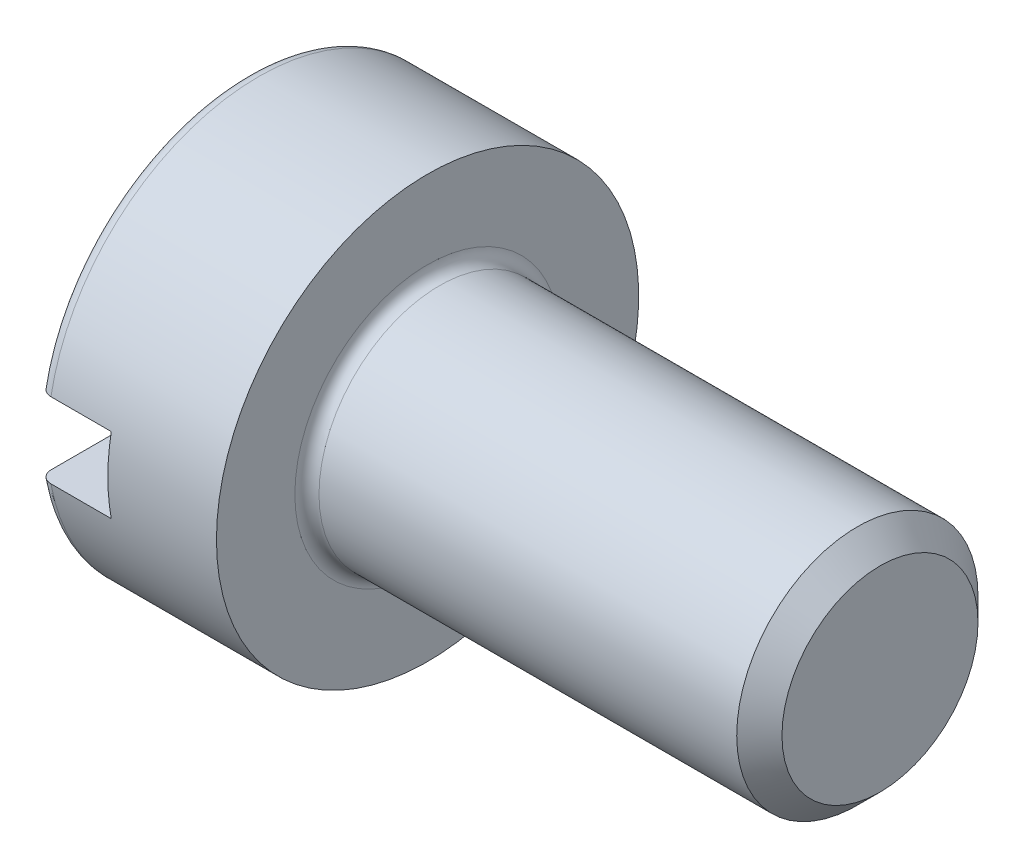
ISO-10303-21;
HEADER;
FILE_DESCRIPTION(('STEP AP214'),'2;1');
FILE_NAME('part.step','',(''),(''),'','','');
FILE_SCHEMA(('AUTOMOTIVE_DESIGN { 1 0 10303 214 1 1 1 1 }'));
ENDSEC;
DATA;
#1=APPLICATION_CONTEXT('core data for automotive mechanical design processes');
#2=APPLICATION_PROTOCOL_DEFINITION('international standard','automotive_design',2000,#1);
#3=PRODUCT_CONTEXT('',#1,'mechanical');
#4=PRODUCT('Part','Part','',(#3));
#5=PRODUCT_RELATED_PRODUCT_CATEGORY('part','',(#4));
#6=PRODUCT_DEFINITION_FORMATION('','',#4);
#7=PRODUCT_DEFINITION_CONTEXT('part definition',#1,'design');
#8=PRODUCT_DEFINITION('design','',#6,#7);
#9=PRODUCT_DEFINITION_SHAPE('','',#8);
#10=(LENGTH_UNIT() NAMED_UNIT(*) SI_UNIT(.MILLI.,.METRE.));
#11=(NAMED_UNIT(*) PLANE_ANGLE_UNIT() SI_UNIT($,.RADIAN.));
#12=(NAMED_UNIT(*) SI_UNIT($,.STERADIAN.) SOLID_ANGLE_UNIT());
#13=UNCERTAINTY_MEASURE_WITH_UNIT(LENGTH_MEASURE(1.E-05),#10,'distance_accuracy_value','');
#14=(GEOMETRIC_REPRESENTATION_CONTEXT(3) GLOBAL_UNCERTAINTY_ASSIGNED_CONTEXT((#13)) GLOBAL_UNIT_ASSIGNED_CONTEXT((#10,
#11,#12)) REPRESENTATION_CONTEXT('',''));
#15=CARTESIAN_POINT('',(0.,0.,0.));
#16=DIRECTION('',(0.,0.,1.));
#17=DIRECTION('',(1.,0.,0.));
#18=AXIS2_PLACEMENT_3D('',#15,#16,#17);
#19=CARTESIAN_POINT('',(0.,0.,0.));
#20=DIRECTION('',(-1.,0.,0.));
#21=DIRECTION('',(0.,0.,1.));
#22=AXIS2_PLACEMENT_3D('',#19,#20,#21);
#23=PLANE('',#22);
#24=DIRECTION('',(0.,0.,-1.));
#25=VECTOR('',#24,1.);
#26=CARTESIAN_POINT('',(0.,1.25,8.));
#27=LINE('',#26,#25);
#28=CARTESIAN_POINT('',(0.,1.25,6.4805478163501));
#29=VERTEX_POINT('',#28);
#30=CARTESIAN_POINT('',(0.,1.25,-6.4805478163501));
#31=VERTEX_POINT('',#30);
#32=EDGE_CURVE('E99',#29,#31,#27,.T.);
#33=ORIENTED_EDGE('',*,*,#32,.F.);
#34=CARTESIAN_POINT('',(0.,0.,0.));
#35=DIRECTION('',(-1.,0.,0.));
#36=DIRECTION('',(0.,0.,1.));
#37=AXIS2_PLACEMENT_3D('',#34,#35,#36);
#38=CIRCLE('',#37,6.6);
#39=EDGE_CURVE('E102',#29,#31,#38,.T.);
#40=ORIENTED_EDGE('',*,*,#39,.T.);
#41=EDGE_LOOP('',(#33,#40));
#42=FACE_BOUND('',#41,.T.);
#43=ADVANCED_FACE('F31',(#42),#23,.T.);
#44=CARTESIAN_POINT('',(0.400000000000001,0.,0.));
#45=DIRECTION('',(-1.,0.,0.));
#46=DIRECTION('',(0.,0.,1.));
#47=AXIS2_PLACEMENT_3D('',#44,#45,#46);
#48=TOROIDAL_SURFACE('',#47,6.6,0.4);
#49=CARTESIAN_POINT('',(0.162448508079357,1.25,-6.80801861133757));
#50=CARTESIAN_POINT('',(0.180259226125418,1.25,-6.82138412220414));
#51=CARTESIAN_POINT('',(0.199199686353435,1.25,-6.83326865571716));
#52=CARTESIAN_POINT('',(0.238818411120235,1.25,-6.85370601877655));
#53=CARTESIAN_POINT('',(0.259498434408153,1.25,-6.86225542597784));
#54=CARTESIAN_POINT('',(0.30200522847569,1.25,-6.87574866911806));
#55=CARTESIAN_POINT('',(0.323831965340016,1.25,-6.88069261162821));
#56=CARTESIAN_POINT('',(0.368002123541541,1.25,-6.88681849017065));
#57=CARTESIAN_POINT('',(0.390345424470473,1.25,-6.88800129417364));
#58=CARTESIAN_POINT('',(0.434774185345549,1.25,-6.88657511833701));
#59=CARTESIAN_POINT('',(0.456860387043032,1.25,-6.88398914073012));
#60=CARTESIAN_POINT('',(0.500285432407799,1.25,-6.87514719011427));
#61=CARTESIAN_POINT('',(0.521624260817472,1.25,-6.86889114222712));
#62=CARTESIAN_POINT('',(0.562966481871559,1.25,-6.85289646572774));
#63=CARTESIAN_POINT('',(0.582969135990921,1.25,-6.84315592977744));
#64=CARTESIAN_POINT('',(0.621076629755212,1.25,-6.82048635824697));
#65=CARTESIAN_POINT('',(0.639181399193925,1.25,-6.80755720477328));
#66=CARTESIAN_POINT('',(0.673176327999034,1.25,-6.77874832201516));
#67=CARTESIAN_POINT('',(0.689042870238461,1.25,-6.76284073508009));
#68=CARTESIAN_POINT('',(0.717929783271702,1.25,-6.72862366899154));
#69=CARTESIAN_POINT('',(0.730949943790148,1.25,-6.71031401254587));
#70=CARTESIAN_POINT('',(0.753992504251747,1.25,-6.67150790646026));
#71=CARTESIAN_POINT('',(0.763964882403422,1.25,-6.65098175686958));
#72=CARTESIAN_POINT('',(0.780382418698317,1.25,-6.60856443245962));
#73=CARTESIAN_POINT('',(0.786827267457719,1.25,-6.58667313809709));
#74=CARTESIAN_POINT('',(0.796105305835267,1.25,-6.54178149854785));
#75=CARTESIAN_POINT('',(0.798880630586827,1.25,-6.51876918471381));
#76=CARTESIAN_POINT('',(0.800566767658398,1.25,-6.47260291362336));
#77=CARTESIAN_POINT('',(0.799477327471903,1.25,-6.44944894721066));
#78=CARTESIAN_POINT('',(0.79343736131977,1.25,-6.40343496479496));
#79=CARTESIAN_POINT('',(0.788451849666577,1.25,-6.380579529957));
#80=CARTESIAN_POINT('',(0.774706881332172,1.25,-6.3360319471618));
#81=CARTESIAN_POINT('',(0.765947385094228,1.25,-6.31433981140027));
#82=CARTESIAN_POINT('',(0.744906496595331,1.25,-6.27279517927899));
#83=CARTESIAN_POINT('',(0.732632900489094,1.25,-6.25293873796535));
#84=CARTESIAN_POINT('',(0.704882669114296,1.25,-6.21560529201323));
#85=CARTESIAN_POINT('',(0.689406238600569,1.25,-6.19812813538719));
#86=CARTESIAN_POINT('',(0.655909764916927,1.25,-6.16631614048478));
#87=CARTESIAN_POINT('',(0.637927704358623,1.25,-6.1519413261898));
#88=CARTESIAN_POINT('',(0.5997653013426,1.25,-6.1264864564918));
#89=CARTESIAN_POINT('',(0.579585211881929,1.25,-6.11540602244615));
#90=CARTESIAN_POINT('',(0.538024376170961,1.25,-6.09708353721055));
#91=CARTESIAN_POINT('',(0.516674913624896,1.25,-6.08977051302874));
#92=CARTESIAN_POINT('',(0.473041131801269,1.25,-6.07889710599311));
#93=CARTESIAN_POINT('',(0.450756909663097,1.25,-6.07533633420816));
#94=CARTESIAN_POINT('',(0.406261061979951,1.25,-6.07211021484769));
#95=CARTESIAN_POINT('',(0.384053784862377,1.25,-6.07238461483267));
#96=CARTESIAN_POINT('',(0.340004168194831,1.25,-6.07667324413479));
#97=CARTESIAN_POINT('',(0.318161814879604,1.25,-6.08068733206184));
#98=CARTESIAN_POINT('',(0.275540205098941,1.25,-6.09230496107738));
#99=CARTESIAN_POINT('',(0.254757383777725,1.25,-6.09989544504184));
#100=CARTESIAN_POINT('',(0.214742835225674,1.25,-6.11842381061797));
#101=CARTESIAN_POINT('',(0.19551116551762,1.25,-6.12936181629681));
#102=CARTESIAN_POINT('',(0.158928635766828,1.25,-6.15438137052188));
#103=CARTESIAN_POINT('',(0.141598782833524,1.25,-6.16849361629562));
#104=CARTESIAN_POINT('',(0.109500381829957,1.25,-6.19937902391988));
#105=CARTESIAN_POINT('',(0.0947320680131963,1.25,-6.2161524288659));
#106=CARTESIAN_POINT('',(0.0678838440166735,1.25,-6.25221458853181));
#107=CARTESIAN_POINT('',(0.0558587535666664,1.25,-6.27154415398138));
#108=CARTESIAN_POINT('',(0.0351576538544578,1.25,-6.31192026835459));
#109=CARTESIAN_POINT('',(0.0264819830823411,1.25,-6.3329669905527));
#110=CARTESIAN_POINT('',(0.0125716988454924,1.25,-6.37658587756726));
#111=CARTESIAN_POINT('',(0.00740161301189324,1.25,-6.39917863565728));
#112=CARTESIAN_POINT('',(0.000888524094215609,1.25,-6.4449088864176));
#113=CARTESIAN_POINT('',(-0.000454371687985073,1.25,-6.46804639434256));
#114=CARTESIAN_POINT('',(0.000730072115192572,1.25,-6.51443782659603));
#115=CARTESIAN_POINT('',(0.00329338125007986,1.25,-6.5376908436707));
#116=CARTESIAN_POINT('',(0.0122983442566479,1.25,-6.58344083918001));
#117=CARTESIAN_POINT('',(0.018740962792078,1.25,-6.60593762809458));
#118=CARTESIAN_POINT('',(0.0353221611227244,1.25,-6.64946841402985));
#119=CARTESIAN_POINT('',(0.0454527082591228,1.25,-6.67050547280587));
#120=CARTESIAN_POINT('',(0.069139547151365,1.25,-6.71053093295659));
#121=CARTESIAN_POINT('',(0.0826915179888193,1.25,-6.72952187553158));
#122=CARTESIAN_POINT('',(0.107380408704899,1.25,-6.75848883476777));
#123=CARTESIAN_POINT('',(0.117619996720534,1.25,-6.76924236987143));
#124=CARTESIAN_POINT('',(0.139222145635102,1.25,-6.78955583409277));
#125=CARTESIAN_POINT('',(0.150584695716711,1.25,-6.79911577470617));
#126=CARTESIAN_POINT('',(0.162448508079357,1.25,-6.80801861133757));
#127=B_SPLINE_CURVE_WITH_KNOTS('',3,(#49,#50,#51,#52,#53,#54,#55,#56,#57,#58,#59,#60,#61,#62,
#63,#64,#65,#66,#67,#68,#69,#70,#71,#72,#73,#74,#75,#76,#77,#78,#79,#80,#81,#82,#83,#84,#85,#86,
#87,#88,#89,#90,#91,#92,#93,#94,#95,#96,#97,#98,#99,#100,#101,#102,#103,#104,#105,#106,#107,
#108,#109,#110,#111,#112,#113,#114,#115,#116,#117,#118,#119,#120,#121,#122,#123,#124,#125,#126),
.UNSPECIFIED.,.T.,.F.,(4,2,2,2,2,2,2,2,2,2,2,2,2,2,2,2,2,2,2,2,2,2,2,2,2,2,2,2,2,2,2,2,2,2,2,2,
2,2,4),(0.,0.0667503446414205,0.133569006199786,0.200385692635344,0.267186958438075,
0.333582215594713,0.399978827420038,0.466411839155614,0.532847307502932,0.599938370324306,
0.667034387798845,0.735178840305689,0.803329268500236,0.872542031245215,0.941759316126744,
1.01160539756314,1.08145221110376,1.15114525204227,1.22083383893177,1.28956228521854,
1.35828282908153,1.42565650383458,1.49302319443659,1.55933272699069,1.62563975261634,
1.69170655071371,1.75777579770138,1.82451377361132,1.89125784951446,1.95923730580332,
2.02722363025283,2.09642968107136,2.16563767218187,2.23548681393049,2.30535333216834,
2.37506857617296,2.44469621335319,2.48915939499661,2.53362214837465),.UNSPECIFIED.);
#128=CARTESIAN_POINT('',(0.400000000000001,1.25,-6.88748865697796));
#129=VERTEX_POINT('',#128);
#130=EDGE_CURVE('E54',#31,#129,#127,.T.);
#131=ORIENTED_EDGE('',*,*,#130,.F.);
#132=ORIENTED_EDGE('',*,*,#39,.F.);
#133=CARTESIAN_POINT('',(0.182390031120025,1.25,6.13839240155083));
#134=CARTESIAN_POINT('',(0.200885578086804,1.25,6.12615548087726));
#135=CARTESIAN_POINT('',(0.220414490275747,1.25,6.11545443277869));
#136=CARTESIAN_POINT('',(0.261003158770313,1.25,6.09746555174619));
#137=CARTESIAN_POINT('',(0.282064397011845,1.25,6.09018107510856));
#138=CARTESIAN_POINT('',(0.325117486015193,1.25,6.07926630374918));
#139=CARTESIAN_POINT('',(0.347109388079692,1.25,6.07563621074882));
#140=CARTESIAN_POINT('',(0.391385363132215,1.25,6.07215072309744));
#141=CARTESIAN_POINT('',(0.413669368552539,1.25,6.07229447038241));
#142=CARTESIAN_POINT('',(0.457737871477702,1.25,6.07633517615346));
#143=CARTESIAN_POINT('',(0.479524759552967,1.25,6.08020613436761));
#144=CARTESIAN_POINT('',(0.52214299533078,1.25,6.09153970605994));
#145=CARTESIAN_POINT('',(0.542974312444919,1.25,6.09900243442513));
#146=CARTESIAN_POINT('',(0.583170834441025,1.25,6.11731639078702));
#147=CARTESIAN_POINT('',(0.602531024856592,1.25,6.12817861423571));
#148=CARTESIAN_POINT('',(0.639189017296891,1.25,6.1529530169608));
#149=CARTESIAN_POINT('',(0.656486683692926,1.25,6.16686539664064));
#150=CARTESIAN_POINT('',(0.688814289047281,1.25,6.1975645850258));
#151=CARTESIAN_POINT('',(0.703805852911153,1.25,6.2143917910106));
#152=CARTESIAN_POINT('',(0.730815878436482,1.25,6.25028299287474));
#153=CARTESIAN_POINT('',(0.742834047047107,1.25,6.26934720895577));
#154=CARTESIAN_POINT('',(0.76379937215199,1.25,6.30956796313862));
#155=CARTESIAN_POINT('',(0.772682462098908,1.25,6.33075790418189));
#156=CARTESIAN_POINT('',(0.786823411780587,1.25,6.37431494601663));
#157=CARTESIAN_POINT('',(0.792080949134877,1.25,6.39668215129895));
#158=CARTESIAN_POINT('',(0.798886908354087,1.25,6.44230833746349));
#159=CARTESIAN_POINT('',(0.800380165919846,1.25,6.4655755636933));
#160=CARTESIAN_POINT('',(0.799455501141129,1.25,6.51203292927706));
#161=CARTESIAN_POINT('',(0.797037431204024,1.25,6.53522306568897));
#162=CARTESIAN_POINT('',(0.78833032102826,1.25,6.58095431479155));
#163=CARTESIAN_POINT('',(0.78202713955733,1.25,6.60349274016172));
#164=CARTESIAN_POINT('',(0.765696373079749,1.25,6.64717837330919));
#165=CARTESIAN_POINT('',(0.755668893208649,1.25,6.66832562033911));
#166=CARTESIAN_POINT('',(0.732248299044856,1.25,6.70844022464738));
#167=CARTESIAN_POINT('',(0.71888275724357,1.25,6.72742367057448));
#168=CARTESIAN_POINT('',(0.689108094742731,1.25,6.76283225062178));
#169=CARTESIAN_POINT('',(0.672699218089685,1.25,6.77925758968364));
#170=CARTESIAN_POINT('',(0.637572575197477,1.25,6.80881060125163));
#171=CARTESIAN_POINT('',(0.618894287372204,1.25,6.82198519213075));
#172=CARTESIAN_POINT('',(0.579562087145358,1.25,6.84495142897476));
#173=CARTESIAN_POINT('',(0.558908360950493,1.25,6.85474339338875));
#174=CARTESIAN_POINT('',(0.516568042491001,1.25,6.87050630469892));
#175=CARTESIAN_POINT('',(0.49490328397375,1.25,6.87653592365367));
#176=CARTESIAN_POINT('',(0.450864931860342,1.25,6.88483007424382));
#177=CARTESIAN_POINT('',(0.428491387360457,1.25,6.88709486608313));
#178=CARTESIAN_POINT('',(0.383916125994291,1.25,6.88778468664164));
#179=CARTESIAN_POINT('',(0.361715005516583,1.25,6.8862489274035));
#180=CARTESIAN_POINT('',(0.317887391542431,1.25,6.87946781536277));
#181=CARTESIAN_POINT('',(0.296260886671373,1.25,6.87422253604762));
#182=CARTESIAN_POINT('',(0.254211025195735,1.25,6.86019019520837));
#183=CARTESIAN_POINT('',(0.233786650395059,1.25,6.8514061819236));
#184=CARTESIAN_POINT('',(0.1946850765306,1.25,6.83056239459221));
#185=CARTESIAN_POINT('',(0.176007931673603,1.25,6.81850251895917));
#186=CARTESIAN_POINT('',(0.140750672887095,1.25,6.79134535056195));
#187=CARTESIAN_POINT('',(0.124190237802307,1.25,6.77622252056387));
#188=CARTESIAN_POINT('',(0.0937970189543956,1.25,6.74344828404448));
#189=CARTESIAN_POINT('',(0.0799644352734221,1.25,6.72579669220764));
#190=CARTESIAN_POINT('',(0.0551943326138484,1.25,6.68818245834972));
#191=CARTESIAN_POINT('',(0.0443037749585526,1.25,6.66818889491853));
#192=CARTESIAN_POINT('',(0.0259731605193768,1.25,6.62667831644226));
#193=CARTESIAN_POINT('',(0.0185334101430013,1.25,6.60516116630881));
#194=CARTESIAN_POINT('',(0.00719584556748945,1.25,6.56084530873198));
#195=CARTESIAN_POINT('',(0.00335663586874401,1.25,6.53803160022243));
#196=CARTESIAN_POINT('',(-0.000480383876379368,1.25,6.49208383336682));
#197=CARTESIAN_POINT('',(-0.000478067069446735,1.25,6.46894976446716));
#198=CARTESIAN_POINT('',(0.00338331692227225,1.25,6.42276596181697));
#199=CARTESIAN_POINT('',(0.00728191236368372,1.25,6.39971952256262));
#200=CARTESIAN_POINT('',(0.0188952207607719,1.25,6.35460140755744));
#201=CARTESIAN_POINT('',(0.0266109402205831,1.25,6.33252999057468));
#202=CARTESIAN_POINT('',(0.0456560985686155,1.25,6.29000627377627));
#203=CARTESIAN_POINT('',(0.0569855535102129,1.25,6.26955398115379));
#204=CARTESIAN_POINT('',(0.0829512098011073,1.25,6.2308920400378));
#205=CARTESIAN_POINT('',(0.0975832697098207,1.25,6.21267962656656));
#206=CARTESIAN_POINT('',(0.124000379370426,1.25,6.1850479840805));
#207=CARTESIAN_POINT('',(0.134941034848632,1.25,6.17480849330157));
#208=CARTESIAN_POINT('',(0.15789423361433,1.25,6.15561026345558));
#209=CARTESIAN_POINT('',(0.169906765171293,1.25,6.14665151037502));
#210=CARTESIAN_POINT('',(0.182390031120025,1.25,6.13839240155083));
#211=B_SPLINE_CURVE_WITH_KNOTS('',3,(#133,#134,#135,#136,#137,#138,#139,#140,#141,#142,#143,
#144,#145,#146,#147,#148,#149,#150,#151,#152,#153,#154,#155,#156,#157,#158,#159,#160,#161,#162,
#163,#164,#165,#166,#167,#168,#169,#170,#171,#172,#173,#174,#175,#176,#177,#178,#179,#180,#181,
#182,#183,#184,#185,#186,#187,#188,#189,#190,#191,#192,#193,#194,#195,#196,#197,#198,#199,#200,
#201,#202,#203,#204,#205,#206,#207,#208,#209,#210),.UNSPECIFIED.,.T.,.F.,(4,2,2,2,2,2,2,2,2,2,2,
2,2,2,2,2,2,2,2,2,2,2,2,2,2,2,2,2,2,2,2,2,2,2,2,2,2,2,4),(0.,0.0664779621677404,
0.133021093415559,0.199567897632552,0.266099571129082,0.332170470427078,0.398243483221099,
0.464532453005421,0.530825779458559,0.598124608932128,0.665430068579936,0.734040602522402,
0.802657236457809,0.872273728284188,0.941892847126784,1.01176687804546,1.08163893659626,
1.15095190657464,1.22025932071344,1.2884986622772,1.35673157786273,1.42387193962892,
1.49100766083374,1.55745360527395,1.62389823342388,1.69028574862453,1.75667532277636,
1.82364306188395,1.89061571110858,1.95860150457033,2.02659333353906,2.0956735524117,
2.16475605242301,2.23454659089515,2.30435554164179,2.37416480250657,2.4438870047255,
2.48875570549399,2.53362391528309),.UNSPECIFIED.);
#212=CARTESIAN_POINT('',(0.400000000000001,1.25,6.88748865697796));
#213=VERTEX_POINT('',#212);
#214=EDGE_CURVE('E91',#213,#29,#211,.T.);
#215=ORIENTED_EDGE('',*,*,#214,.F.);
#216=CARTESIAN_POINT('',(0.400000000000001,0.,0.));
#217=DIRECTION('',(-1.,0.,0.));
#218=DIRECTION('',(0.,0.,1.));
#219=AXIS2_PLACEMENT_3D('',#216,#217,#218);
#220=CIRCLE('',#219,7.);
#221=EDGE_CURVE('E106',#129,#213,#220,.F.);
#222=ORIENTED_EDGE('',*,*,#221,.F.);
#223=EDGE_LOOP('',(#131,#132,#215,#222));
#224=FACE_BOUND('',#223,.T.);
#225=ADVANCED_FACE('F183',(#224),#48,.T.);
#226=CARTESIAN_POINT('',(-25.4,0.,0.));
#227=DIRECTION('',(-1.,0.,0.));
#228=DIRECTION('',(0.,0.,1.));
#229=AXIS2_PLACEMENT_3D('',#226,#227,#228);
#230=CYLINDRICAL_SURFACE('',#229,4.);
#231=CARTESIAN_POINT('',(20.25,0.,0.));
#232=DIRECTION('',(1.,0.,0.));
#233=DIRECTION('',(0.,0.,-1.));
#234=AXIS2_PLACEMENT_3D('',#231,#232,#233);
#235=CIRCLE('',#234,4.);
#236=CARTESIAN_POINT('',(20.25,0.,4.));
#237=VERTEX_POINT('',#236);
#238=EDGE_CURVE('E39',#237,#237,#235,.F.);
#239=ORIENTED_EDGE('',*,*,#238,.T.);
#240=EDGE_LOOP('',(#239));
#241=FACE_BOUND('',#240,.T.);
#242=CARTESIAN_POINT('',(6.4,0.,0.));
#243=DIRECTION('',(-1.,0.,0.));
#244=DIRECTION('',(0.,0.,1.));
#245=AXIS2_PLACEMENT_3D('',#242,#243,#244);
#246=CIRCLE('',#245,4.);
#247=CARTESIAN_POINT('',(6.4,0.,4.));
#248=VERTEX_POINT('',#247);
#249=EDGE_CURVE('E103',#248,#248,#246,.F.);
#250=ORIENTED_EDGE('',*,*,#249,.T.);
#251=EDGE_LOOP('',(#250));
#252=FACE_BOUND('',#251,.T.);
#253=ADVANCED_FACE('F33',(#241,#252),#230,.T.);
#254=CARTESIAN_POINT('',(21.,4.,0.));
#255=DIRECTION('',(1.,0.,0.));
#256=DIRECTION('',(0.,0.,-1.));
#257=AXIS2_PLACEMENT_3D('',#254,#255,#256);
#258=PLANE('',#257);
#259=CARTESIAN_POINT('',(21.,0.,0.));
#260=DIRECTION('',(1.,0.,0.));
#261=DIRECTION('',(0.,0.,-1.));
#262=AXIS2_PLACEMENT_3D('',#259,#260,#261);
#263=CIRCLE('',#262,3.25);
#264=CARTESIAN_POINT('',(21.,0.,3.25));
#265=VERTEX_POINT('',#264);
#266=EDGE_CURVE('E11',#265,#265,#263,.T.);
#267=ORIENTED_EDGE('',*,*,#266,.T.);
#268=EDGE_LOOP('',(#267));
#269=FACE_BOUND('',#268,.T.);
#270=ADVANCED_FACE('F196',(#269),#258,.T.);
#271=DIRECTION('',(0.,0.,1.));
#272=VECTOR('',#271,1.);
#273=CARTESIAN_POINT('',(0.,-1.25,-8.));
#274=LINE('',#273,#272);
#275=CARTESIAN_POINT('',(0.,-1.25,-6.4805478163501));
#276=VERTEX_POINT('',#275);
#277=CARTESIAN_POINT('',(0.,-1.25,6.4805478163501));
#278=VERTEX_POINT('',#277);
#279=EDGE_CURVE('E46',#276,#278,#274,.T.);
#280=ORIENTED_EDGE('',*,*,#279,.F.);
#281=EDGE_CURVE('E97',#276,#278,#38,.T.);
#282=ORIENTED_EDGE('',*,*,#281,.T.);
#283=EDGE_LOOP('',(#280,#282));
#284=FACE_BOUND('',#283,.T.);
#285=ADVANCED_FACE('F96',(#284),#23,.T.);
#286=CARTESIAN_POINT('',(-25.4,0.,0.));
#287=DIRECTION('',(-1.,0.,0.));
#288=DIRECTION('',(0.,0.,1.));
#289=AXIS2_PLACEMENT_3D('',#286,#287,#288);
#290=CYLINDRICAL_SURFACE('',#289,7.);
#291=DIRECTION('',(-1.,0.,0.));
#292=VECTOR('',#291,1.);
#293=CARTESIAN_POINT('',(-25.4,1.25,-6.88748865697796));
#294=LINE('',#293,#292);
#295=CARTESIAN_POINT('',(2.4,1.25,-6.88748865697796));
#296=VERTEX_POINT('',#295);
#297=EDGE_CURVE('E151',#129,#296,#294,.F.);
#298=ORIENTED_EDGE('',*,*,#297,.F.);
#299=ORIENTED_EDGE('',*,*,#221,.T.);
#300=DIRECTION('',(-1.,0.,0.));
#301=VECTOR('',#300,1.);
#302=CARTESIAN_POINT('',(-25.4,1.25,6.88748865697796));
#303=LINE('',#302,#301);
#304=CARTESIAN_POINT('',(2.4,1.25,6.88748865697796));
#305=VERTEX_POINT('',#304);
#306=EDGE_CURVE('E165',#305,#213,#303,.T.);
#307=ORIENTED_EDGE('',*,*,#306,.F.);
#308=CARTESIAN_POINT('',(2.4,0.,0.));
#309=DIRECTION('',(-1.,0.,0.));
#310=DIRECTION('',(0.,0.,1.));
#311=AXIS2_PLACEMENT_3D('',#308,#309,#310);
#312=CIRCLE('',#311,7.);
#313=CARTESIAN_POINT('',(2.4,-1.25,6.88748865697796));
#314=VERTEX_POINT('',#313);
#315=EDGE_CURVE('E140',#305,#314,#312,.F.);
#316=ORIENTED_EDGE('',*,*,#315,.T.);
#317=DIRECTION('',(-1.,0.,0.));
#318=VECTOR('',#317,1.);
#319=CARTESIAN_POINT('',(-25.4,-1.25,6.88748865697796));
#320=LINE('',#319,#318);
#321=CARTESIAN_POINT('',(0.400000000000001,-1.25,6.88748865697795));
#322=VERTEX_POINT('',#321);
#323=EDGE_CURVE('E159',#322,#314,#320,.F.);
#324=ORIENTED_EDGE('',*,*,#323,.F.);
#325=CARTESIAN_POINT('',(0.39999999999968,-1.25,-6.8874886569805));
#326=VERTEX_POINT('',#325);
#327=EDGE_CURVE('E112',#322,#326,#220,.F.);
#328=ORIENTED_EDGE('',*,*,#327,.T.);
#329=DIRECTION('',(-1.,0.,0.));
#330=VECTOR('',#329,1.);
#331=CARTESIAN_POINT('',(-25.4,-1.25,-6.88748865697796));
#332=LINE('',#331,#330);
#333=CARTESIAN_POINT('',(2.4,-1.25,-6.88748865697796));
#334=VERTEX_POINT('',#333);
#335=EDGE_CURVE('E86',#334,#326,#332,.T.);
#336=ORIENTED_EDGE('',*,*,#335,.F.);
#337=EDGE_CURVE('E142',#334,#296,#312,.F.);
#338=ORIENTED_EDGE('',*,*,#337,.T.);
#339=EDGE_LOOP('',(#298,#299,#307,#316,#324,#328,#336,#338));
#340=FACE_BOUND('',#339,.T.);
#341=CARTESIAN_POINT('',(6.,0.,0.));
#342=DIRECTION('',(-1.,0.,0.));
#343=DIRECTION('',(0.,0.,1.));
#344=AXIS2_PLACEMENT_3D('',#341,#342,#343);
#345=CIRCLE('',#344,7.);
#346=CARTESIAN_POINT('',(6.,0.,7.));
#347=VERTEX_POINT('',#346);
#348=EDGE_CURVE('E168',#347,#347,#345,.T.);
#349=ORIENTED_EDGE('',*,*,#348,.T.);
#350=EDGE_LOOP('',(#349));
#351=FACE_BOUND('',#350,.T.);
#352=ADVANCED_FACE('F148',(#340,#351),#290,.T.);
#353=CARTESIAN_POINT('',(6.,4.,0.));
#354=DIRECTION('',(-1.,0.,0.));
#355=DIRECTION('',(0.,0.,1.));
#356=AXIS2_PLACEMENT_3D('',#353,#354,#355);
#357=PLANE('',#356);
#358=CARTESIAN_POINT('',(6.,0.,0.));
#359=DIRECTION('',(-1.,0.,0.));
#360=DIRECTION('',(0.,0.,1.));
#361=AXIS2_PLACEMENT_3D('',#358,#359,#360);
#362=CIRCLE('',#361,4.4);
#363=CARTESIAN_POINT('',(6.,0.,4.4));
#364=VERTEX_POINT('',#363);
#365=EDGE_CURVE('E108',#364,#364,#362,.T.);
#366=ORIENTED_EDGE('',*,*,#365,.T.);
#367=EDGE_LOOP('',(#366));
#368=FACE_BOUND('',#367,.T.);
#369=ORIENTED_EDGE('',*,*,#348,.F.);
#370=EDGE_LOOP('',(#369));
#371=FACE_BOUND('',#370,.T.);
#372=ADVANCED_FACE('F173',(#368,#371),#357,.F.);
#373=CARTESIAN_POINT('',(6.4,0.,0.));
#374=DIRECTION('',(-1.,0.,0.));
#375=DIRECTION('',(0.,0.,1.));
#376=AXIS2_PLACEMENT_3D('',#373,#374,#375);
#377=TOROIDAL_SURFACE('',#376,4.4,0.4);
#378=ORIENTED_EDGE('',*,*,#249,.F.);
#379=EDGE_LOOP('',(#378));
#380=FACE_BOUND('',#379,.T.);
#381=ORIENTED_EDGE('',*,*,#365,.F.);
#382=EDGE_LOOP('',(#381));
#383=FACE_BOUND('',#382,.T.);
#384=ADVANCED_FACE('F176',(#380,#383),#377,.F.);
#385=CARTESIAN_POINT('',(0.162448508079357,-1.25,-6.80801861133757));
#386=CARTESIAN_POINT('',(0.144241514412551,-1.25,-6.79435316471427));
#387=CARTESIAN_POINT('',(0.127188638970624,-1.25,-6.77911951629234));
#388=CARTESIAN_POINT('',(0.0958807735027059,-1.25,-6.74598128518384));
#389=CARTESIAN_POINT('',(0.0816297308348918,-1.25,-6.72807299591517));
#390=CARTESIAN_POINT('',(0.0563383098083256,-1.25,-6.6901469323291));
#391=CARTESIAN_POINT('',(0.0452941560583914,-1.25,-6.67013167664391));
#392=CARTESIAN_POINT('',(0.0266807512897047,-1.25,-6.62855440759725));
#393=CARTESIAN_POINT('',(0.0191106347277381,-1.25,-6.60699278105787));
#394=CARTESIAN_POINT('',(0.0075566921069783,-1.25,-6.56265237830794));
#395=CARTESIAN_POINT('',(0.0036170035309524,-1.25,-6.5398620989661));
#396=CARTESIAN_POINT('',(-0.000424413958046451,-1.25,-6.49394226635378));
#397=CARTESIAN_POINT('',(-0.000525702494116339,-1.25,-6.47081267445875));
#398=CARTESIAN_POINT('',(0.00312792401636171,-1.25,-6.42461501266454));
#399=CARTESIAN_POINT('',(0.00692326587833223,-1.25,-6.40155012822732));
#400=CARTESIAN_POINT('',(0.0183325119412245,-1.25,-6.35638392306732));
#401=CARTESIAN_POINT('',(0.0259464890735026,-1.25,-6.33428262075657));
#402=CARTESIAN_POINT('',(0.0447922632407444,-1.25,-6.29168683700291));
#403=CARTESIAN_POINT('',(0.0560229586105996,-1.25,-6.27119186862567));
#404=CARTESIAN_POINT('',(0.081806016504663,-1.25,-6.2324088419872));
#405=CARTESIAN_POINT('',(0.0963581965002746,-1.25,-6.21412066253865));
#406=CARTESIAN_POINT('',(0.128190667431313,-1.25,-6.18051944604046));
#407=CARTESIAN_POINT('',(0.145435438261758,-1.25,-6.16517277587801));
#408=CARTESIAN_POINT('',(0.182300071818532,-1.25,-6.13766081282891));
#409=CARTESIAN_POINT('',(0.20191967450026,-1.25,-6.12549517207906));
#410=CARTESIAN_POINT('',(0.242571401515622,-1.25,-6.10494095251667));
#411=CARTESIAN_POINT('',(0.263568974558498,-1.25,-6.09648403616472));
#412=CARTESIAN_POINT('',(0.306700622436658,-1.25,-6.08328450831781));
#413=CARTESIAN_POINT('',(0.328834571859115,-1.25,-6.07854148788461));
#414=CARTESIAN_POINT('',(0.373208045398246,-1.25,-6.07297398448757));
#415=CARTESIAN_POINT('',(0.395439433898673,-1.25,-6.07208450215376));
#416=CARTESIAN_POINT('',(0.439732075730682,-1.25,-6.07407472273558));
#417=CARTESIAN_POINT('',(0.461793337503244,-1.25,-6.07695423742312));
#418=CARTESIAN_POINT('',(0.504988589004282,-1.25,-6.08636148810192));
#419=CARTESIAN_POINT('',(0.526127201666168,-1.25,-6.09286803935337));
#420=CARTESIAN_POINT('',(0.567025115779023,-1.25,-6.10930949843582));
#421=CARTESIAN_POINT('',(0.586784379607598,-1.25,-6.11924449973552));
#422=CARTESIAN_POINT('',(0.624544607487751,-1.25,-6.14233452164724));
#423=CARTESIAN_POINT('',(0.642529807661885,-1.25,-6.15551530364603));
#424=CARTESIAN_POINT('',(0.676081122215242,-1.25,-6.18466047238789));
#425=CARTESIAN_POINT('',(0.691647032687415,-1.25,-6.20062509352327));
#426=CARTESIAN_POINT('',(0.720215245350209,-1.25,-6.23518544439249));
#427=CARTESIAN_POINT('',(0.733167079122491,-1.25,-6.25382288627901));
#428=CARTESIAN_POINT('',(0.755825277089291,-1.25,-6.29297567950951));
#429=CARTESIAN_POINT('',(0.765531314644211,-1.25,-6.31349121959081));
#430=CARTESIAN_POINT('',(0.781605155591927,-1.25,-6.35622821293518));
#431=CARTESIAN_POINT('',(0.787907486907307,-1.25,-6.37847430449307));
#432=CARTESIAN_POINT('',(0.796733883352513,-1.25,-6.42370423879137));
#433=CARTESIAN_POINT('',(0.799257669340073,-1.25,-6.44668813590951));
#434=CARTESIAN_POINT('',(0.80046649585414,-1.25,-6.49301200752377));
#435=CARTESIAN_POINT('',(0.799108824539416,-1.25,-6.51635311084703));
#436=CARTESIAN_POINT('',(0.792491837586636,-1.25,-6.56247645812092));
#437=CARTESIAN_POINT('',(0.787232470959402,-1.25,-6.585258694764));
#438=CARTESIAN_POINT('',(0.772948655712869,-1.25,-6.62959191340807));
#439=CARTESIAN_POINT('',(0.763927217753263,-1.25,-6.65114386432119));
#440=CARTESIAN_POINT('',(0.742353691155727,-1.25,-6.69240278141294));
#441=CARTESIAN_POINT('',(0.72980177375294,-1.25,-6.71210983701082));
#442=CARTESIAN_POINT('',(0.701668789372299,-1.25,-6.74887278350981));
#443=CARTESIAN_POINT('',(0.686123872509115,-1.25,-6.76595632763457));
#444=CARTESIAN_POINT('',(0.65234373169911,-1.25,-6.79721725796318));
#445=CARTESIAN_POINT('',(0.634108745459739,-1.25,-6.81139490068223));
#446=CARTESIAN_POINT('',(0.595787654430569,-1.25,-6.83619336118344));
#447=CARTESIAN_POINT('',(0.575736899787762,-1.25,-6.84686880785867));
#448=CARTESIAN_POINT('',(0.534109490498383,-1.25,-6.86464414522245));
#449=CARTESIAN_POINT('',(0.5125330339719,-1.25,-6.87174449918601));
#450=CARTESIAN_POINT('',(0.468806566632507,-1.25,-6.88206865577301));
#451=CARTESIAN_POINT('',(0.446669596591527,-1.25,-6.88534774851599));
#452=CARTESIAN_POINT('',(0.402154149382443,-1.25,-6.88811396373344));
#453=CARTESIAN_POINT('',(0.379775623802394,-1.25,-6.88760031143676));
#454=CARTESIAN_POINT('',(0.335577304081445,-1.25,-6.88281282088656));
#455=CARTESIAN_POINT('',(0.313754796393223,-1.25,-6.87856383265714));
#456=CARTESIAN_POINT('',(0.271149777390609,-1.25,-6.86647255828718));
#457=CARTESIAN_POINT('',(0.250366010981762,-1.25,-6.85863473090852));
#458=CARTESIAN_POINT('',(0.218418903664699,-1.25,-6.84343234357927));
#459=CARTESIAN_POINT('',(0.206735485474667,-1.25,-6.83713475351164));
#460=CARTESIAN_POINT('',(0.184053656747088,-1.25,-6.82340837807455));
#461=CARTESIAN_POINT('',(0.173055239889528,-1.25,-6.8159796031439));
#462=CARTESIAN_POINT('',(0.162448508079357,-1.25,-6.80801861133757));
#463=B_SPLINE_CURVE_WITH_KNOTS('',3,(#385,#386,#387,#388,#389,#390,#391,#392,#393,#394,#395,
#396,#397,#398,#399,#400,#401,#402,#403,#404,#405,#406,#407,#408,#409,#410,#411,#412,#413,#414,
#415,#416,#417,#418,#419,#420,#421,#422,#423,#424,#425,#426,#427,#428,#429,#430,#431,#432,#433,
#434,#435,#436,#437,#438,#439,#440,#441,#442,#443,#444,#445,#446,#447,#448,#449,#450,#451,#452,
#453,#454,#455,#456,#457,#458,#459,#460,#461,#462),.UNSPECIFIED.,.T.,.F.,(4,2,2,2,2,2,2,2,2,2,2,
2,2,2,2,2,2,2,2,2,2,2,2,2,2,2,2,2,2,2,2,2,2,2,2,2,2,2,4),(0.,0.0682451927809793,
0.136585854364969,0.204845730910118,0.273088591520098,0.342150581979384,0.411220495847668,
0.481014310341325,0.550809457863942,0.620583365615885,0.690353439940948,0.75927070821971,
0.828180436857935,0.895760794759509,0.963333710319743,1.02976229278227,1.0961875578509,
1.16222885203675,1.22827194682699,1.29485714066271,1.3614479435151,1.4292220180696,
1.49700291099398,1.56604495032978,1.63509208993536,1.70490194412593,1.77471271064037,
1.84446771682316,1.91421934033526,1.98317607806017,2.05212672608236,2.11994412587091,
2.18775273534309,2.25456753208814,2.32139597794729,2.38778317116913,2.45408810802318,
2.49384564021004,2.53360280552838),.UNSPECIFIED.);
#464=EDGE_CURVE('E82',#326,#276,#463,.T.);
#465=ORIENTED_EDGE('',*,*,#464,.F.);
#466=ORIENTED_EDGE('',*,*,#327,.F.);
#467=CARTESIAN_POINT('',(0.182390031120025,-1.25,6.13839240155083));
#468=CARTESIAN_POINT('',(0.163398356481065,-1.25,6.15096001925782));
#469=CARTESIAN_POINT('',(0.1454685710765,-1.25,6.16516604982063));
#470=CARTESIAN_POINT('',(0.11224653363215,-1.25,6.19641222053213));
#471=CARTESIAN_POINT('',(0.0969581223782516,-1.25,6.21345641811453));
#472=CARTESIAN_POINT('',(0.069461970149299,-1.25,6.24983700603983));
#473=CARTESIAN_POINT('',(0.0572502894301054,-1.25,6.26917041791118));
#474=CARTESIAN_POINT('',(0.036199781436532,-1.25,6.30958466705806));
#475=CARTESIAN_POINT('',(0.027360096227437,-1.25,6.33066505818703));
#476=CARTESIAN_POINT('',(0.0131739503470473,-1.25,6.37428467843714));
#477=CARTESIAN_POINT('',(0.00787609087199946,-1.25,6.39683971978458));
#478=CARTESIAN_POINT('',(0.0011015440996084,-1.25,6.44251819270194));
#479=CARTESIAN_POINT('',(-0.000374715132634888,-1.25,6.46564168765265));
#480=CARTESIAN_POINT('',(0.000540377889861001,-1.25,6.51203491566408));
#481=CARTESIAN_POINT('',(0.00296891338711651,-1.25,6.53530392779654));
#482=CARTESIAN_POINT('',(0.0117069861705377,-1.25,6.58110239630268));
#483=CARTESIAN_POINT('',(0.0180165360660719,-1.25,6.6036318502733));
#484=CARTESIAN_POINT('',(0.0343373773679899,-1.25,6.64724630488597));
#485=CARTESIAN_POINT('',(0.0443396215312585,-1.25,6.66833468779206));
#486=CARTESIAN_POINT('',(0.0677855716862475,-1.25,6.70850374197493));
#487=CARTESIAN_POINT('',(0.0812290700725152,-1.25,6.72758453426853));
#488=CARTESIAN_POINT('',(0.111002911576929,-1.25,6.76293635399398));
#489=CARTESIAN_POINT('',(0.127295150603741,-1.25,6.77923946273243));
#490=CARTESIAN_POINT('',(0.162425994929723,-1.25,6.80882267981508));
#491=CARTESIAN_POINT('',(0.181264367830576,-1.25,6.82210306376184));
#492=CARTESIAN_POINT('',(0.220616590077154,-1.25,6.84503052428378));
#493=CARTESIAN_POINT('',(0.241097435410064,-1.25,6.85473425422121));
#494=CARTESIAN_POINT('',(0.283412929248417,-1.25,6.87051042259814));
#495=CARTESIAN_POINT('',(0.305247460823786,-1.25,6.87658317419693));
#496=CARTESIAN_POINT('',(0.349326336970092,-1.25,6.88484722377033));
#497=CARTESIAN_POINT('',(0.371560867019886,-1.25,6.88709093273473));
#498=CARTESIAN_POINT('',(0.416088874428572,-1.25,6.88778948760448));
#499=CARTESIAN_POINT('',(0.438382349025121,-1.25,6.88624450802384));
#500=CARTESIAN_POINT('',(0.482259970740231,-1.25,6.87943434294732));
#501=CARTESIAN_POINT('',(0.503847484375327,-1.25,6.87419080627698));
#502=CARTESIAN_POINT('',(0.545841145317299,-1.25,6.86016833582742));
#503=CARTESIAN_POINT('',(0.566247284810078,-1.25,6.85138937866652));
#504=CARTESIAN_POINT('',(0.605395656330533,-1.25,6.83051806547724));
#505=CARTESIAN_POINT('',(0.624130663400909,-1.25,6.81841216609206));
#506=CARTESIAN_POINT('',(0.65933450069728,-1.25,6.79126316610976));
#507=CARTESIAN_POINT('',(0.675803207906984,-1.25,6.77621990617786));
#508=CARTESIAN_POINT('',(0.706231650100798,-1.25,6.743427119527));
#509=CARTESIAN_POINT('',(0.720157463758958,-1.25,6.72564612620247));
#510=CARTESIAN_POINT('',(0.744882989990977,-1.25,6.68802995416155));
#511=CARTESIAN_POINT('',(0.755682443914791,-1.25,6.66819460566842));
#512=CARTESIAN_POINT('',(0.774034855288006,-1.25,6.62668586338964));
#513=CARTESIAN_POINT('',(0.781531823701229,-1.25,6.60498771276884));
#514=CARTESIAN_POINT('',(0.792832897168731,-1.25,6.56065008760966));
#515=CARTESIAN_POINT('',(0.796636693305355,-1.25,6.53801053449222));
#516=CARTESIAN_POINT('',(0.800487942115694,-1.25,6.49209499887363));
#517=CARTESIAN_POINT('',(0.800482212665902,-1.25,6.46881454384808));
#518=CARTESIAN_POINT('',(0.796585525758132,-1.25,6.42258035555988));
#519=CARTESIAN_POINT('',(0.792694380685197,-1.25,6.39962663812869));
#520=CARTESIAN_POINT('',(0.781096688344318,-1.25,6.35457076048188));
#521=CARTESIAN_POINT('',(0.77336968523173,-1.25,6.33247385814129));
#522=CARTESIAN_POINT('',(0.754291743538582,-1.25,6.28990274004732));
#523=CARTESIAN_POINT('',(0.742940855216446,-1.25,6.26942850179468));
#524=CARTESIAN_POINT('',(0.717003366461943,-1.25,6.23084030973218));
#525=CARTESIAN_POINT('',(0.702438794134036,-1.25,6.21271156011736));
#526=CARTESIAN_POINT('',(0.670425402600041,-1.25,6.17920867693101));
#527=CARTESIAN_POINT('',(0.652976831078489,-1.25,6.16383430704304));
#528=CARTESIAN_POINT('',(0.616000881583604,-1.25,6.13655924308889));
#529=CARTESIAN_POINT('',(0.596513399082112,-1.25,6.12460447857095));
#530=CARTESIAN_POINT('',(0.555778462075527,-1.25,6.10421209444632));
#531=CARTESIAN_POINT('',(0.534531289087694,-1.25,6.09577391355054));
#532=CARTESIAN_POINT('',(0.49132488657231,-1.25,6.08281971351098));
#533=CARTESIAN_POINT('',(0.469387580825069,-1.25,6.07823051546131));
#534=CARTESIAN_POINT('',(0.425046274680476,-1.25,6.07284932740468));
#535=CARTESIAN_POINT('',(0.402642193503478,-1.25,6.07205800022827));
#536=CARTESIAN_POINT('',(0.358286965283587,-1.25,6.07428611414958));
#537=CARTESIAN_POINT('',(0.336333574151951,-1.25,6.07726173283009));
#538=CARTESIAN_POINT('',(0.29325714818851,-1.25,6.08685235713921));
#539=CARTESIAN_POINT('',(0.272133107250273,-1.25,6.09346279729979));
#540=CARTESIAN_POINT('',(0.239596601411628,-1.25,6.10671697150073));
#541=CARTESIAN_POINT('',(0.227722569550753,-1.25,6.11225803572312));
#542=CARTESIAN_POINT('',(0.204578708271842,-1.25,6.12448302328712));
#543=CARTESIAN_POINT('',(0.193308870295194,-1.25,6.13116693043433));
#544=CARTESIAN_POINT('',(0.182390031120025,-1.25,6.13839240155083));
#545=B_SPLINE_CURVE_WITH_KNOTS('',3,(#467,#468,#469,#470,#471,#472,#473,#474,#475,#476,#477,
#478,#479,#480,#481,#482,#483,#484,#485,#486,#487,#488,#489,#490,#491,#492,#493,#494,#495,#496,
#497,#498,#499,#500,#501,#502,#503,#504,#505,#506,#507,#508,#509,#510,#511,#512,#513,#514,#515,
#516,#517,#518,#519,#520,#521,#522,#523,#524,#525,#526,#527,#528,#529,#530,#531,#532,#533,#534,
#535,#536,#537,#538,#539,#540,#541,#542,#543,#544),.UNSPECIFIED.,.T.,.F.,(4,2,2,2,2,2,2,2,2,2,2,
2,2,2,2,2,2,2,2,2,2,2,2,2,2,2,2,2,2,2,2,2,2,2,2,2,2,2,4),(0.,0.0682713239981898,
0.13664109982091,0.204922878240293,0.273187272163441,0.342370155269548,0.411560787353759,
0.481414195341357,0.551267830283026,0.620951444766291,0.690630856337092,0.759441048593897,
0.828244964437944,0.895906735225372,0.963562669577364,1.03028488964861,1.09700403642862,
1.16333586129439,1.22966812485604,1.29627451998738,1.36288452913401,1.43032684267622,
1.49777473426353,1.56632580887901,1.6348826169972,1.70439651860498,1.77391377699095,
1.84380580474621,1.91369686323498,1.98312296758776,2.05254311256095,2.12079577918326,
2.18903754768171,2.25595039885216,2.3228749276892,2.38902800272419,2.45509817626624,
2.49434980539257,2.53360087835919),.UNSPECIFIED.);
#546=EDGE_CURVE('E92',#278,#322,#545,.T.);
#547=ORIENTED_EDGE('',*,*,#546,.F.);
#548=ORIENTED_EDGE('',*,*,#281,.F.);
#549=EDGE_LOOP('',(#465,#466,#547,#548));
#550=FACE_BOUND('',#549,.T.);
#551=ADVANCED_FACE('F101',(#550),#48,.T.);
#552=CARTESIAN_POINT('',(2.4,1.25,8.));
#553=DIRECTION('',(0.,1.,0.));
#554=DIRECTION('',(0.,0.,1.));
#555=AXIS2_PLACEMENT_3D('',#552,#553,#554);
#556=PLANE('',#555);
#557=ORIENTED_EDGE('',*,*,#297,.T.);
#558=DIRECTION('',(0.,0.,-1.));
#559=VECTOR('',#558,1.);
#560=CARTESIAN_POINT('',(2.4,1.25,8.));
#561=LINE('',#560,#559);
#562=EDGE_CURVE('E98',#305,#296,#561,.T.);
#563=ORIENTED_EDGE('',*,*,#562,.F.);
#564=ORIENTED_EDGE('',*,*,#306,.T.);
#565=ORIENTED_EDGE('',*,*,#214,.T.);
#566=ORIENTED_EDGE('',*,*,#32,.T.);
#567=ORIENTED_EDGE('',*,*,#130,.T.);
#568=EDGE_LOOP('',(#557,#563,#564,#565,#566,#567));
#569=FACE_BOUND('',#568,.T.);
#570=ADVANCED_FACE('F128',(#569),#556,.F.);
#571=CARTESIAN_POINT('',(2.4,-1.25,-8.));
#572=DIRECTION('',(0.,-1.,0.));
#573=DIRECTION('',(0.,0.,-1.));
#574=AXIS2_PLACEMENT_3D('',#571,#572,#573);
#575=PLANE('',#574);
#576=ORIENTED_EDGE('',*,*,#335,.T.);
#577=ORIENTED_EDGE('',*,*,#464,.T.);
#578=ORIENTED_EDGE('',*,*,#279,.T.);
#579=ORIENTED_EDGE('',*,*,#546,.T.);
#580=ORIENTED_EDGE('',*,*,#323,.T.);
#581=DIRECTION('',(0.,0.,1.));
#582=VECTOR('',#581,1.);
#583=CARTESIAN_POINT('',(2.4,-1.25,-8.));
#584=LINE('',#583,#582);
#585=EDGE_CURVE('E156',#334,#314,#584,.T.);
#586=ORIENTED_EDGE('',*,*,#585,.F.);
#587=EDGE_LOOP('',(#576,#577,#578,#579,#580,#586));
#588=FACE_BOUND('',#587,.T.);
#589=ADVANCED_FACE('F83',(#588),#575,.F.);
#590=CARTESIAN_POINT('',(2.4,1.25,-8.));
#591=DIRECTION('',(-1.,0.,0.));
#592=DIRECTION('',(0.,0.,1.));
#593=AXIS2_PLACEMENT_3D('',#590,#591,#592);
#594=PLANE('',#593);
#595=ORIENTED_EDGE('',*,*,#585,.T.);
#596=ORIENTED_EDGE('',*,*,#315,.F.);
#597=ORIENTED_EDGE('',*,*,#562,.T.);
#598=ORIENTED_EDGE('',*,*,#337,.F.);
#599=EDGE_LOOP('',(#595,#596,#597,#598));
#600=FACE_BOUND('',#599,.T.);
#601=ADVANCED_FACE('F127',(#600),#594,.T.);
#602=CARTESIAN_POINT('',(20.25,0.,0.));
#603=DIRECTION('',(-1.,0.,0.));
#604=DIRECTION('',(0.,0.,1.));
#605=AXIS2_PLACEMENT_3D('',#602,#603,#604);
#606=CONICAL_SURFACE('',#605,4.,0.785398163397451);
#607=CARTESIAN_POINT('',(21.,0.,3.25));
#608=CARTESIAN_POINT('',(20.9921875,0.,3.2578125));
#609=CARTESIAN_POINT('',(20.984375,0.,3.265625));
#610=CARTESIAN_POINT('',(20.96875,0.,3.28125));
#611=CARTESIAN_POINT('',(20.9609375,0.,3.2890625));
#612=CARTESIAN_POINT('',(20.9453125,0.,3.3046875));
#613=CARTESIAN_POINT('',(20.9375,0.,3.3125));
#614=CARTESIAN_POINT('',(20.921875,0.,3.328125));
#615=CARTESIAN_POINT('',(20.9140625,0.,3.3359375));
#616=CARTESIAN_POINT('',(20.8984375,0.,3.3515625));
#617=CARTESIAN_POINT('',(20.890625,0.,3.359375));
#618=CARTESIAN_POINT('',(20.875,0.,3.375));
#619=CARTESIAN_POINT('',(20.8671875,0.,3.3828125));
#620=CARTESIAN_POINT('',(20.8515625,0.,3.3984375));
#621=CARTESIAN_POINT('',(20.84375,0.,3.40625));
#622=CARTESIAN_POINT('',(20.828125,0.,3.421875));
#623=CARTESIAN_POINT('',(20.8203125,0.,3.4296875));
#624=CARTESIAN_POINT('',(20.8046875,0.,3.4453125));
#625=CARTESIAN_POINT('',(20.796875,0.,3.453125));
#626=CARTESIAN_POINT('',(20.78125,0.,3.46875));
#627=CARTESIAN_POINT('',(20.7734375,0.,3.4765625));
#628=CARTESIAN_POINT('',(20.7578125,0.,3.4921875));
#629=CARTESIAN_POINT('',(20.75,0.,3.5));
#630=CARTESIAN_POINT('',(20.734375,0.,3.515625));
#631=CARTESIAN_POINT('',(20.7265625,0.,3.5234375));
#632=CARTESIAN_POINT('',(20.7109375,0.,3.5390625));
#633=CARTESIAN_POINT('',(20.703125,0.,3.546875));
#634=CARTESIAN_POINT('',(20.6875,0.,3.5625));
#635=CARTESIAN_POINT('',(20.6796875,0.,3.5703125));
#636=CARTESIAN_POINT('',(20.6640625,0.,3.5859375));
#637=CARTESIAN_POINT('',(20.65625,0.,3.59375));
#638=CARTESIAN_POINT('',(20.640625,0.,3.609375));
#639=CARTESIAN_POINT('',(20.6328125,0.,3.6171875));
#640=CARTESIAN_POINT('',(20.6171875,0.,3.6328125));
#641=CARTESIAN_POINT('',(20.609375,0.,3.640625));
#642=CARTESIAN_POINT('',(20.59375,0.,3.65625));
#643=CARTESIAN_POINT('',(20.5859375,0.,3.6640625));
#644=CARTESIAN_POINT('',(20.5703125,0.,3.6796875));
#645=CARTESIAN_POINT('',(20.5625,0.,3.6875));
#646=CARTESIAN_POINT('',(20.546875,0.,3.703125));
#647=CARTESIAN_POINT('',(20.5390625,0.,3.7109375));
#648=CARTESIAN_POINT('',(20.5234375,0.,3.7265625));
#649=CARTESIAN_POINT('',(20.515625,0.,3.734375));
#650=CARTESIAN_POINT('',(20.5,0.,3.75));
#651=CARTESIAN_POINT('',(20.4921875,0.,3.7578125));
#652=CARTESIAN_POINT('',(20.4765625,0.,3.7734375));
#653=CARTESIAN_POINT('',(20.46875,0.,3.78125));
#654=CARTESIAN_POINT('',(20.453125,0.,3.796875));
#655=CARTESIAN_POINT('',(20.4453125,0.,3.8046875));
#656=CARTESIAN_POINT('',(20.4296875,0.,3.8203125));
#657=CARTESIAN_POINT('',(20.421875,0.,3.828125));
#658=CARTESIAN_POINT('',(20.40625,0.,3.84375));
#659=CARTESIAN_POINT('',(20.3984375,0.,3.8515625));
#660=CARTESIAN_POINT('',(20.3828125,0.,3.8671875));
#661=CARTESIAN_POINT('',(20.375,0.,3.875));
#662=CARTESIAN_POINT('',(20.359375,0.,3.890625));
#663=CARTESIAN_POINT('',(20.3515625,0.,3.8984375));
#664=CARTESIAN_POINT('',(20.3359375,0.,3.9140625));
#665=CARTESIAN_POINT('',(20.328125,0.,3.921875));
#666=CARTESIAN_POINT('',(20.3125,0.,3.9375));
#667=CARTESIAN_POINT('',(20.3046875,0.,3.9453125));
#668=CARTESIAN_POINT('',(20.2890625,0.,3.9609375));
#669=CARTESIAN_POINT('',(20.28125,0.,3.96875));
#670=CARTESIAN_POINT('',(20.265625,0.,3.984375));
#671=CARTESIAN_POINT('',(20.2578125,0.,3.9921875));
#672=CARTESIAN_POINT('',(20.25,0.,4.));
#673=B_SPLINE_CURVE_WITH_KNOTS('',3,(#607,#608,#609,#610,#611,#612,#613,#614,#615,#616,#617,
#618,#619,#620,#621,#622,#623,#624,#625,#626,#627,#628,#629,#630,#631,#632,#633,#634,#635,#636,
#637,#638,#639,#640,#641,#642,#643,#644,#645,#646,#647,#648,#649,#650,#651,#652,#653,#654,#655,
#656,#657,#658,#659,#660,#661,#662,#663,#664,#665,#666,#667,#668,#669,#670,#671,#672),
.UNSPECIFIED.,.F.,.F.,(4,2,2,2,2,2,2,2,2,2,2,2,2,2,2,2,2,2,2,2,2,2,2,2,2,2,2,2,2,2,2,2,4),(0.,
0.0331456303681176,0.0662912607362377,0.0994368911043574,0.132582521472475,0.165728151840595,
0.198873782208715,0.232019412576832,0.265165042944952,0.298310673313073,0.33145630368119,
0.36460193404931,0.39774756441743,0.430893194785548,0.464038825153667,0.497184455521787,
0.530330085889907,0.563475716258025,0.596621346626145,0.629766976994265,0.662912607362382,
0.696058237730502,0.729203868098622,0.76234949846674,0.79549512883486,0.82864075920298,
0.861786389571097,0.894932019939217,0.928077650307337,0.961223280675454,0.994368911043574,
1.02751454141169,1.06066017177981),.UNSPECIFIED.);
#674=EDGE_CURVE('BSEAM207',#265,#237,#673,.T.);
#675=ORIENTED_EDGE('',*,*,#266,.F.);
#676=ORIENTED_EDGE('',*,*,#238,.F.);
#677=ORIENTED_EDGE('',*,*,#674,.T.);
#678=ORIENTED_EDGE('',*,*,#674,.F.);
#679=EDGE_LOOP('',(#675,#677,#676,#678));
#680=FACE_BOUND('',#679,.T.);
#681=ADVANCED_FACE('F207',(#680),#606,.T.);
#682=CLOSED_SHELL('',(#43,#225,#253,#270,#285,#352,#372,#384,#551,#570,#589,#601,#681));
#683=MANIFOLD_SOLID_BREP('B2',#682);
#684=ADVANCED_BREP_SHAPE_REPRESENTATION('',(#18,#683),#14);
#685=SHAPE_DEFINITION_REPRESENTATION(#9,#684);
ENDSEC;
END-ISO-10303-21;
